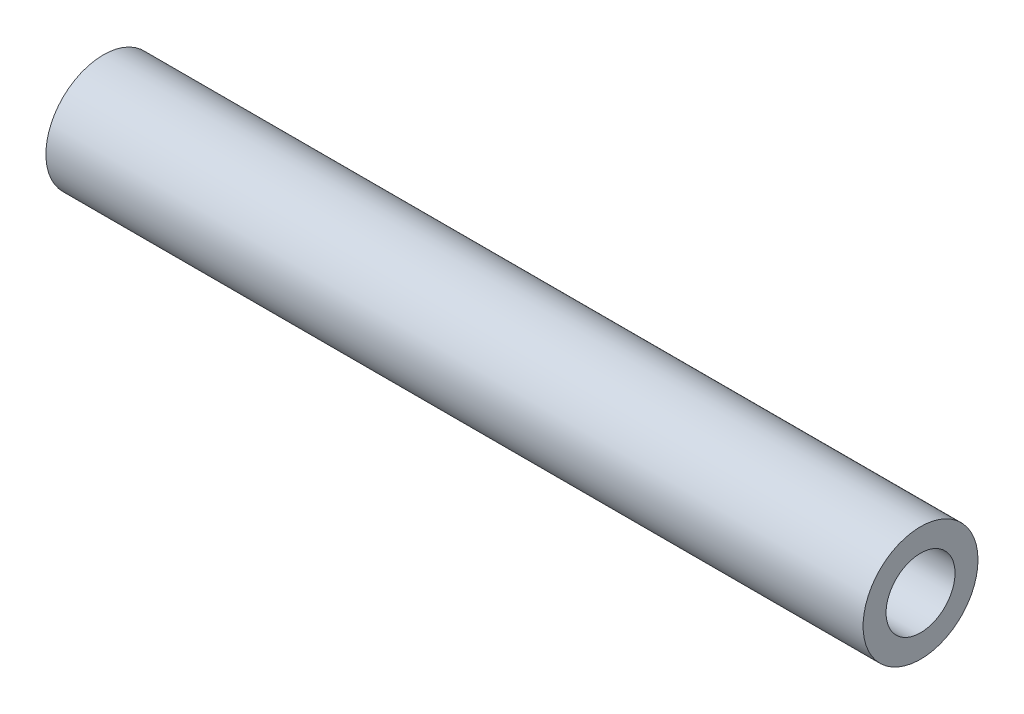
ISO-10303-21;
HEADER;
FILE_DESCRIPTION(('STEP AP214'),'2;1');
FILE_NAME('part.step','',(''),(''),'','','');
FILE_SCHEMA(('AUTOMOTIVE_DESIGN { 1 0 10303 214 1 1 1 1 }'));
ENDSEC;
DATA;
#1=APPLICATION_CONTEXT('core data for automotive mechanical design processes');
#2=APPLICATION_PROTOCOL_DEFINITION('international standard','automotive_design',2000,#1);
#3=PRODUCT_CONTEXT('',#1,'mechanical');
#4=PRODUCT('Part','Part','',(#3));
#5=PRODUCT_RELATED_PRODUCT_CATEGORY('part','',(#4));
#6=PRODUCT_DEFINITION_FORMATION('','',#4);
#7=PRODUCT_DEFINITION_CONTEXT('part definition',#1,'design');
#8=PRODUCT_DEFINITION('design','',#6,#7);
#9=PRODUCT_DEFINITION_SHAPE('','',#8);
#10=(LENGTH_UNIT() NAMED_UNIT(*) SI_UNIT(.MILLI.,.METRE.));
#11=(NAMED_UNIT(*) PLANE_ANGLE_UNIT() SI_UNIT($,.RADIAN.));
#12=(NAMED_UNIT(*) SI_UNIT($,.STERADIAN.) SOLID_ANGLE_UNIT());
#13=UNCERTAINTY_MEASURE_WITH_UNIT(LENGTH_MEASURE(1.E-05),#10,'distance_accuracy_value','');
#14=(GEOMETRIC_REPRESENTATION_CONTEXT(3) GLOBAL_UNCERTAINTY_ASSIGNED_CONTEXT((#13)) GLOBAL_UNIT_ASSIGNED_CONTEXT((#10,
#11,#12)) REPRESENTATION_CONTEXT('',''));
#15=CARTESIAN_POINT('',(0.,0.,0.));
#16=DIRECTION('',(0.,0.,1.));
#17=DIRECTION('',(1.,0.,0.));
#18=AXIS2_PLACEMENT_3D('',#15,#16,#17);
#19=CARTESIAN_POINT('',(-28.4442166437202,0.,0.));
#20=DIRECTION('',(1.,0.,0.));
#21=DIRECTION('',(0.,0.,-1.));
#22=AXIS2_PLACEMENT_3D('',#19,#20,#21);
#23=PLANE('',#22);
#24=CARTESIAN_POINT('',(-28.4442166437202,0.,0.));
#25=DIRECTION('',(1.,0.,0.));
#26=DIRECTION('',(0.,0.,-1.));
#27=AXIS2_PLACEMENT_3D('',#24,#25,#26);
#28=CIRCLE('',#27,1.2);
#29=CARTESIAN_POINT('',(-28.4442166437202,0.,-1.2));
#30=VERTEX_POINT('',#29);
#31=EDGE_CURVE('E49',#30,#30,#28,.T.);
#32=ORIENTED_EDGE('',*,*,#31,.T.);
#33=EDGE_LOOP('',(#32));
#34=FACE_BOUND('',#33,.T.);
#35=CARTESIAN_POINT('',(-28.4442166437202,0.,0.));
#36=DIRECTION('',(1.,0.,0.));
#37=DIRECTION('',(0.,0.,-1.));
#38=AXIS2_PLACEMENT_3D('',#35,#36,#37);
#39=CIRCLE('',#38,2.);
#40=CARTESIAN_POINT('',(-28.4442166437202,0.,-2.));
#41=VERTEX_POINT('',#40);
#42=EDGE_CURVE('E39',#41,#41,#39,.T.);
#43=ORIENTED_EDGE('',*,*,#42,.F.);
#44=EDGE_LOOP('',(#43));
#45=FACE_BOUND('',#44,.T.);
#46=ADVANCED_FACE('F35',(#34,#45),#23,.F.);
#47=CARTESIAN_POINT('',(0.,0.,0.));
#48=DIRECTION('',(1.,0.,0.));
#49=DIRECTION('',(0.,0.,-1.));
#50=AXIS2_PLACEMENT_3D('',#47,#48,#49);
#51=PLANE('',#50);
#52=CARTESIAN_POINT('',(0.,0.,0.));
#53=DIRECTION('',(1.,0.,0.));
#54=DIRECTION('',(0.,0.,-1.));
#55=AXIS2_PLACEMENT_3D('',#52,#53,#54);
#56=CIRCLE('',#55,1.2);
#57=CARTESIAN_POINT('',(0.,0.,-1.2));
#58=VERTEX_POINT('',#57);
#59=EDGE_CURVE('E43',#58,#58,#56,.T.);
#60=ORIENTED_EDGE('',*,*,#59,.F.);
#61=EDGE_LOOP('',(#60));
#62=FACE_BOUND('',#61,.T.);
#63=CARTESIAN_POINT('',(0.,0.,0.));
#64=DIRECTION('',(1.,0.,0.));
#65=DIRECTION('',(0.,0.,-1.));
#66=AXIS2_PLACEMENT_3D('',#63,#64,#65);
#67=CIRCLE('',#66,2.);
#68=CARTESIAN_POINT('',(0.,0.,-2.));
#69=VERTEX_POINT('',#68);
#70=EDGE_CURVE('E11',#69,#69,#67,.T.);
#71=ORIENTED_EDGE('',*,*,#70,.T.);
#72=EDGE_LOOP('',(#71));
#73=FACE_BOUND('',#72,.T.);
#74=ADVANCED_FACE('F59',(#62,#73),#51,.T.);
#75=CARTESIAN_POINT('',(0.,0.,0.));
#76=DIRECTION('',(-1.,0.,0.));
#77=DIRECTION('',(0.,0.,1.));
#78=AXIS2_PLACEMENT_3D('',#75,#76,#77);
#79=CYLINDRICAL_SURFACE('',#78,2.);
#80=ORIENTED_EDGE('',*,*,#70,.F.);
#81=EDGE_LOOP('',(#80));
#82=FACE_BOUND('',#81,.T.);
#83=ORIENTED_EDGE('',*,*,#42,.T.);
#84=EDGE_LOOP('',(#83));
#85=FACE_BOUND('',#84,.T.);
#86=ADVANCED_FACE('F56',(#82,#85),#79,.T.);
#87=CARTESIAN_POINT('',(0.,0.,0.));
#88=DIRECTION('',(-1.,0.,0.));
#89=DIRECTION('',(0.,0.,1.));
#90=AXIS2_PLACEMENT_3D('',#87,#88,#89);
#91=CYLINDRICAL_SURFACE('',#90,1.2);
#92=ORIENTED_EDGE('',*,*,#59,.T.);
#93=EDGE_LOOP('',(#92));
#94=FACE_BOUND('',#93,.T.);
#95=ORIENTED_EDGE('',*,*,#31,.F.);
#96=EDGE_LOOP('',(#95));
#97=FACE_BOUND('',#96,.T.);
#98=ADVANCED_FACE('F37',(#94,#97),#91,.F.);
#99=CLOSED_SHELL('',(#46,#74,#86,#98));
#100=MANIFOLD_SOLID_BREP('B2',#99);
#101=ADVANCED_BREP_SHAPE_REPRESENTATION('',(#18,#100),#14);
#102=SHAPE_DEFINITION_REPRESENTATION(#9,#101);
ENDSEC;
END-ISO-10303-21;
